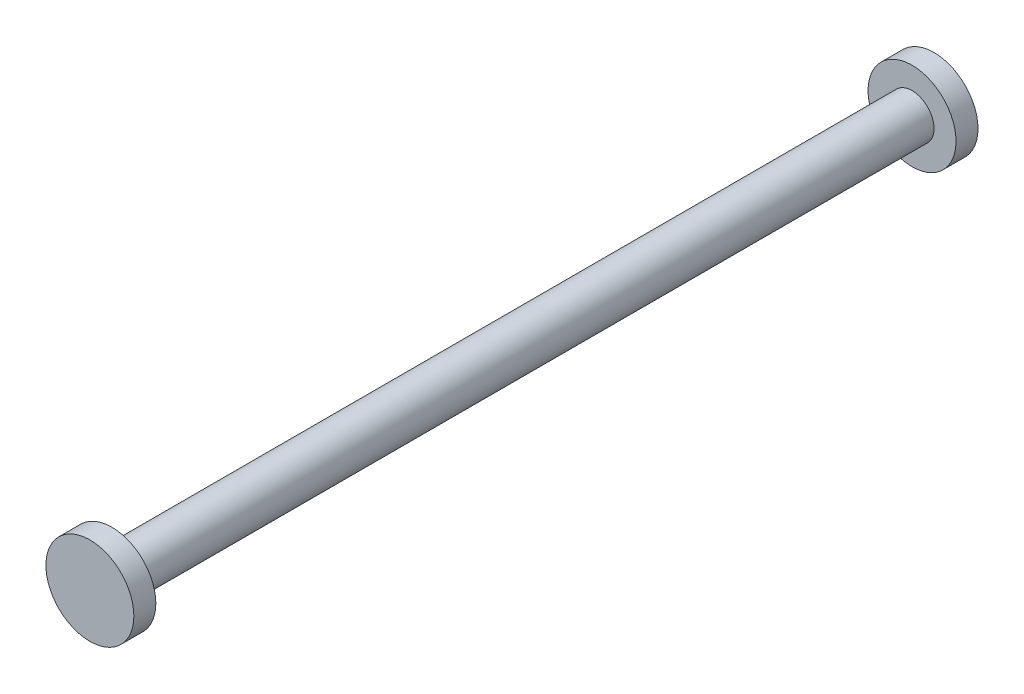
ISO-10303-21;
HEADER;
FILE_DESCRIPTION(('STEP AP214'),'2;1');
FILE_NAME('part.step','',(''),(''),'','','');
FILE_SCHEMA(('AUTOMOTIVE_DESIGN { 1 0 10303 214 1 1 1 1 }'));
ENDSEC;
DATA;
#1=APPLICATION_CONTEXT('core data for automotive mechanical design processes');
#2=APPLICATION_PROTOCOL_DEFINITION('international standard','automotive_design',2000,#1);
#3=PRODUCT_CONTEXT('',#1,'mechanical');
#4=PRODUCT('Part','Part','',(#3));
#5=PRODUCT_RELATED_PRODUCT_CATEGORY('part','',(#4));
#6=PRODUCT_DEFINITION_FORMATION('','',#4);
#7=PRODUCT_DEFINITION_CONTEXT('part definition',#1,'design');
#8=PRODUCT_DEFINITION('design','',#6,#7);
#9=PRODUCT_DEFINITION_SHAPE('','',#8);
#10=(LENGTH_UNIT() NAMED_UNIT(*) SI_UNIT(.MILLI.,.METRE.));
#11=(NAMED_UNIT(*) PLANE_ANGLE_UNIT() SI_UNIT($,.RADIAN.));
#12=(NAMED_UNIT(*) SI_UNIT($,.STERADIAN.) SOLID_ANGLE_UNIT());
#13=UNCERTAINTY_MEASURE_WITH_UNIT(LENGTH_MEASURE(1.E-05),#10,'distance_accuracy_value','');
#14=(GEOMETRIC_REPRESENTATION_CONTEXT(3) GLOBAL_UNCERTAINTY_ASSIGNED_CONTEXT((#13)) GLOBAL_UNIT_ASSIGNED_CONTEXT((#10,
#11,#12)) REPRESENTATION_CONTEXT('',''));
#15=CARTESIAN_POINT('',(0.,0.,0.));
#16=DIRECTION('',(0.,0.,1.));
#17=DIRECTION('',(1.,0.,0.));
#18=AXIS2_PLACEMENT_3D('',#15,#16,#17);
#19=CARTESIAN_POINT('',(0.,0.,5.));
#20=DIRECTION('',(0.,0.,-1.));
#21=DIRECTION('',(-1.,0.,0.));
#22=AXIS2_PLACEMENT_3D('',#19,#20,#21);
#23=CYLINDRICAL_SURFACE('',#22,10.);
#24=CARTESIAN_POINT('',(0.,0.,5.));
#25=DIRECTION('',(0.,0.,1.));
#26=DIRECTION('',(1.,0.,0.));
#27=AXIS2_PLACEMENT_3D('',#24,#25,#26);
#28=CIRCLE('',#27,10.);
#29=CARTESIAN_POINT('',(10.,0.,5.));
#30=VERTEX_POINT('',#29);
#31=EDGE_CURVE('E38',#30,#30,#28,.T.);
#32=ORIENTED_EDGE('',*,*,#31,.F.);
#33=EDGE_LOOP('',(#32));
#34=FACE_BOUND('',#33,.T.);
#35=CARTESIAN_POINT('',(0.,0.,0.));
#36=DIRECTION('',(0.,0.,1.));
#37=DIRECTION('',(1.,0.,0.));
#38=AXIS2_PLACEMENT_3D('',#35,#36,#37);
#39=CIRCLE('',#38,10.);
#40=CARTESIAN_POINT('',(10.,0.,0.));
#41=VERTEX_POINT('',#40);
#42=EDGE_CURVE('E34',#41,#41,#39,.T.);
#43=ORIENTED_EDGE('',*,*,#42,.T.);
#44=EDGE_LOOP('',(#43));
#45=FACE_BOUND('',#44,.T.);
#46=ADVANCED_FACE('F31',(#34,#45),#23,.T.);
#47=CARTESIAN_POINT('',(0.,0.,5.));
#48=DIRECTION('',(0.,0.,1.));
#49=DIRECTION('',(1.,0.,0.));
#50=AXIS2_PLACEMENT_3D('',#47,#48,#49);
#51=PLANE('',#50);
#52=CARTESIAN_POINT('',(0.,0.,5.));
#53=DIRECTION('',(0.,0.,1.));
#54=DIRECTION('',(1.,0.,0.));
#55=AXIS2_PLACEMENT_3D('',#52,#53,#54);
#56=CIRCLE('',#55,5.);
#57=CARTESIAN_POINT('',(5.,0.,5.));
#58=VERTEX_POINT('',#57);
#59=EDGE_CURVE('E10',#58,#58,#56,.T.);
#60=ORIENTED_EDGE('',*,*,#59,.F.);
#61=EDGE_LOOP('',(#60));
#62=FACE_BOUND('',#61,.T.);
#63=ORIENTED_EDGE('',*,*,#31,.T.);
#64=EDGE_LOOP('',(#63));
#65=FACE_BOUND('',#64,.T.);
#66=ADVANCED_FACE('F72',(#62,#65),#51,.T.);
#67=CARTESIAN_POINT('',(0.,0.,0.));
#68=DIRECTION('',(0.,0.,1.));
#69=DIRECTION('',(1.,0.,0.));
#70=AXIS2_PLACEMENT_3D('',#67,#68,#69);
#71=PLANE('',#70);
#72=ORIENTED_EDGE('',*,*,#42,.F.);
#73=EDGE_LOOP('',(#72));
#74=FACE_BOUND('',#73,.T.);
#75=ADVANCED_FACE('F77',(#74),#71,.F.);
#76=CARTESIAN_POINT('',(0.,0.,187.));
#77=DIRECTION('',(0.,0.,-1.));
#78=DIRECTION('',(-1.,0.,0.));
#79=AXIS2_PLACEMENT_3D('',#76,#77,#78);
#80=CYLINDRICAL_SURFACE('',#79,5.);
#81=CARTESIAN_POINT('',(0.,0.,187.));
#82=DIRECTION('',(0.,0.,1.));
#83=DIRECTION('',(1.,0.,0.));
#84=AXIS2_PLACEMENT_3D('',#81,#82,#83);
#85=CIRCLE('',#84,5.);
#86=CARTESIAN_POINT('',(5.,0.,187.));
#87=VERTEX_POINT('',#86);
#88=EDGE_CURVE('E44',#87,#87,#85,.T.);
#89=ORIENTED_EDGE('',*,*,#88,.F.);
#90=EDGE_LOOP('',(#89));
#91=FACE_BOUND('',#90,.T.);
#92=ORIENTED_EDGE('',*,*,#59,.T.);
#93=EDGE_LOOP('',(#92));
#94=FACE_BOUND('',#93,.T.);
#95=ADVANCED_FACE('F59',(#91,#94),#80,.T.);
#96=CARTESIAN_POINT('',(0.,0.,192.));
#97=DIRECTION('',(0.,0.,-1.));
#98=DIRECTION('',(-1.,0.,0.));
#99=AXIS2_PLACEMENT_3D('',#96,#97,#98);
#100=CYLINDRICAL_SURFACE('',#99,10.);
#101=CARTESIAN_POINT('',(0.,0.,192.));
#102=DIRECTION('',(0.,0.,1.));
#103=DIRECTION('',(1.,0.,0.));
#104=AXIS2_PLACEMENT_3D('',#101,#102,#103);
#105=CIRCLE('',#104,10.);
#106=CARTESIAN_POINT('',(10.,0.,192.));
#107=VERTEX_POINT('',#106);
#108=EDGE_CURVE('E47',#107,#107,#105,.T.);
#109=ORIENTED_EDGE('',*,*,#108,.F.);
#110=EDGE_LOOP('',(#109));
#111=FACE_BOUND('',#110,.T.);
#112=CARTESIAN_POINT('',(0.,0.,187.));
#113=DIRECTION('',(0.,0.,1.));
#114=DIRECTION('',(1.,0.,0.));
#115=AXIS2_PLACEMENT_3D('',#112,#113,#114);
#116=CIRCLE('',#115,10.);
#117=CARTESIAN_POINT('',(10.,0.,187.));
#118=VERTEX_POINT('',#117);
#119=EDGE_CURVE('E48',#118,#118,#116,.T.);
#120=ORIENTED_EDGE('',*,*,#119,.T.);
#121=EDGE_LOOP('',(#120));
#122=FACE_BOUND('',#121,.T.);
#123=ADVANCED_FACE('F56',(#111,#122),#100,.T.);
#124=CARTESIAN_POINT('',(0.,0.,192.));
#125=DIRECTION('',(0.,0.,1.));
#126=DIRECTION('',(1.,0.,0.));
#127=AXIS2_PLACEMENT_3D('',#124,#125,#126);
#128=PLANE('',#127);
#129=ORIENTED_EDGE('',*,*,#108,.T.);
#130=EDGE_LOOP('',(#129));
#131=FACE_BOUND('',#130,.T.);
#132=ADVANCED_FACE('F54',(#131),#128,.T.);
#133=CARTESIAN_POINT('',(0.,0.,187.));
#134=DIRECTION('',(0.,0.,1.));
#135=DIRECTION('',(1.,0.,0.));
#136=AXIS2_PLACEMENT_3D('',#133,#134,#135);
#137=PLANE('',#136);
#138=ORIENTED_EDGE('',*,*,#88,.T.);
#139=EDGE_LOOP('',(#138));
#140=FACE_BOUND('',#139,.T.);
#141=ORIENTED_EDGE('',*,*,#119,.F.);
#142=EDGE_LOOP('',(#141));
#143=FACE_BOUND('',#142,.T.);
#144=ADVANCED_FACE('F63',(#140,#143),#137,.F.);
#145=CLOSED_SHELL('',(#46,#66,#75,#95,#123,#132,#144));
#146=MANIFOLD_SOLID_BREP('B2',#145);
#147=ADVANCED_BREP_SHAPE_REPRESENTATION('',(#18,#146),#14);
#148=SHAPE_DEFINITION_REPRESENTATION(#9,#147);
ENDSEC;
END-ISO-10303-21;
